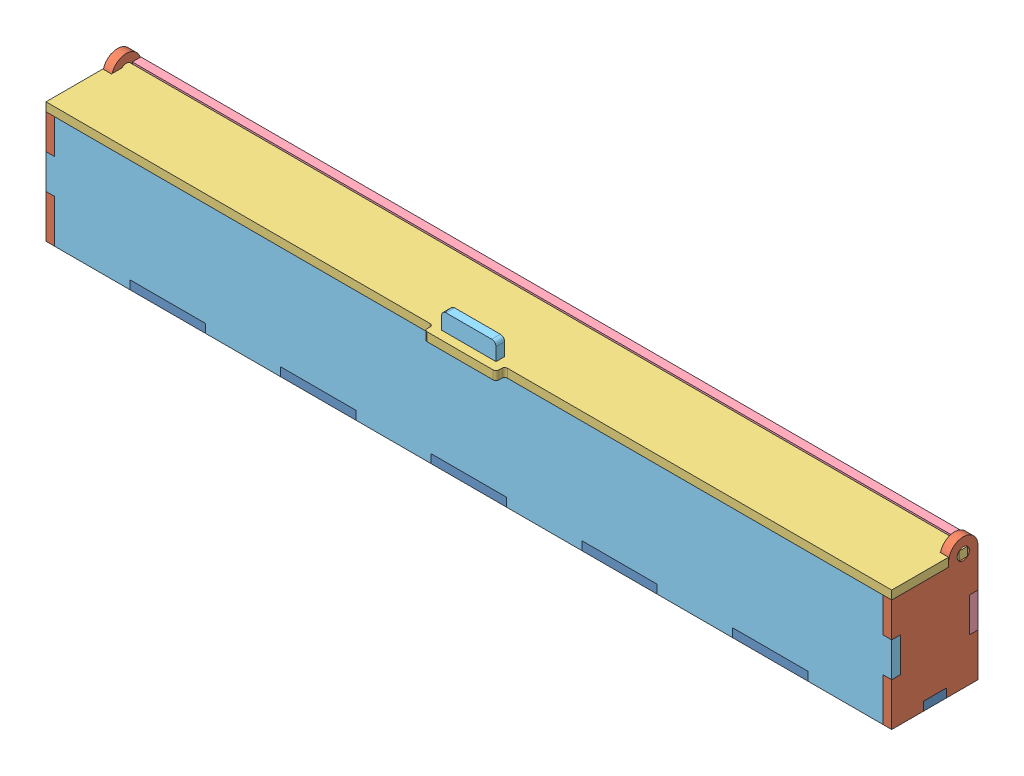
SolidWorks assembly main.SLDASM, configuration Default (file format 8000). Lengths in mm.
Overall size (311.15 50.8 34.93).
6 component instances, 5 part files, 15 mates.
Components (placement in the parent):
- bottom-1: bottom.SLDPRT [Default] at (136.8785 136.702 245.3348) size (311.15 3.17 31.75)
- side-1: side.SLDPRT [Default] at (-46.4056 139.877 232.6348) x (0 0 -1) z (0 -1 0) size (31.75 3.17 48.28)
- side-2: side.SLDPRT [Default] at (261.5694 139.877 232.6348) x (0 0 -1) z (0 -1 0) size (31.75 3.17 48.28)
- Lid-1: Lid.SLDPRT [Default] at (109.1694 177.977 246.9223) size (311.15 3.17 31.09)
- back-1: back.SLDPRT [Default] at (109.1694 139.877 216.7598) x (1 0 0) z (0 -1 0) size (311.15 3.17 44.45)
- front-1: front.SLDPRT [Default] at (109.1694 139.877 245.3348) x (1 0 0) z (0 -1 0) size (311.15 3.17 50.8)
Mates (geometry in assembly coordinates):
- Coincident4: coincident anti-aligned: plane of bottom-1 through (136.8785 139.877 245.3348) normal (0 1 0); plane of side-1 through (-43.2306 139.877 228.4015) normal (0 -1 0)
- Coincident5: coincident anti-aligned: plane of bottom-1 through (-43.2306 139.877 245.3348) normal (-1 0 0); plane of side-1 through (-43.2306 179.5645 222.1799) normal (1 0 0)
- Coincident6: coincident anti-aligned: plane of bottom-1 through (-43.2306 139.877 236.8682) normal (0 0 1); plane of side-1 through (-43.2306 139.877 236.8682) normal (0 0 -1)
- Coincident7: coincident anti-aligned: plane of bottom-1 through (136.8785 139.877 245.3348) normal (0 1 0); plane of side-2 through (264.7444 139.877 228.4015) normal (0 -1 0)
- Coincident8: coincident anti-aligned: plane of bottom-1 through (261.5694 139.877 236.8682) normal (1 0 0); plane of side-2 through (261.5694 179.5645 222.1799) normal (-1 0 0)
- Coincident9: coincident anti-aligned: plane of bottom-1 through (264.7444 139.877 236.8682) normal (0 0 1); plane of side-2 through (264.7444 139.877 236.8682) normal (0 0 -1)
- Coincident10: coincident anti-aligned: plane of side-2 through (261.5694 179.5645 222.1799) normal (-1 0 0); plane of Lid-1 through (261.5694 181.152 223.7674) normal (1 0 0)
- Coincident15: coincident anti-aligned: line of side-2 through (264.7444 179.5645 222.1799) axis (-1 0 0); line of Lid-1 through (-46.4056 179.5645 222.1799) axis (1 0 0)
- Coincident16: coincident anti-aligned: plane of bottom-1 through (67.6058 139.877 219.9348) normal (0 0 -1); plane of back-1 through (109.1694 139.877 219.9348) normal (0 0 1)
- Coincident17: coincident anti-aligned: plane of bottom-1 through (136.8785 139.877 245.3348) normal (0 1 0); plane of back-1 through (95.3149 139.877 219.9348) normal (0 -1 0)
- Coincident18: coincident anti-aligned: plane of bottom-1 through (67.6058 139.877 216.7598) normal (1 0 0); plane of back-1 through (67.6058 139.877 219.9348) normal (-1 0 0)
- LimitAngle1: limit planar angle anti-aligned: plane of side-1 through (-43.2306 177.977 248.5098) normal (0 1 0); plane of Lid-1 through (123.4028 177.977 249.5682) normal (0 -1 0)
- Coincident25: coincident anti-aligned: plane of bottom-1 through (136.8785 139.877 245.3348) normal (0 1 0); plane of front-1 through (123.024 139.877 248.5098) normal (0 -1 0)
- Coincident26: coincident anti-aligned: plane of bottom-1 through (95.3149 139.877 245.3348) normal (0 0 1); plane of front-1 through (100.7569 185.9145 245.3348) normal (0 0 -1)
- Coincident27: coincident anti-aligned: plane of bottom-1 through (123.024 139.877 245.3348) normal (1 0 0); plane of front-1 through (123.024 136.702 248.5098) normal (-1 0 0)
